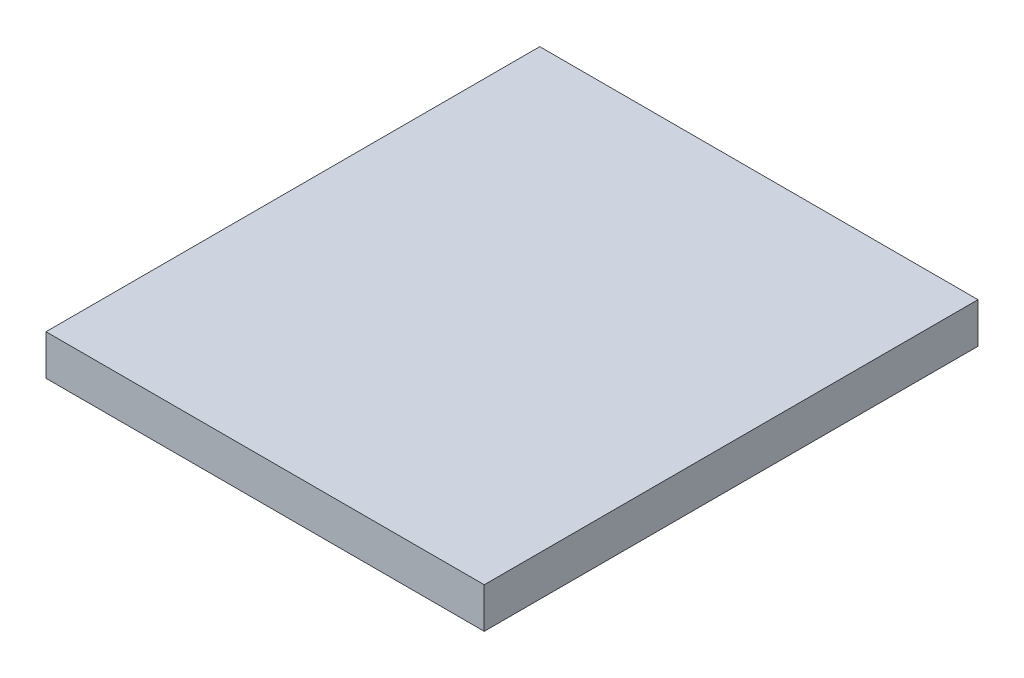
from build123d import *

# Parameters (mm, degrees)
SKETCH1_W      = 22.544133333
SKETCH1_H      = 2.076433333
EXTRUDE1_DEPTH = 25.4


with BuildPart() as part:
    # Sketch1 → Extrude1 (new body)
    with BuildSketch(Plane.XY):
        with Locations((11.272066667, -1.038216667)):
            Rectangle(SKETCH1_W, SKETCH1_H)
    extrude(amount=EXTRUDE1_DEPTH)


solid = part.part
